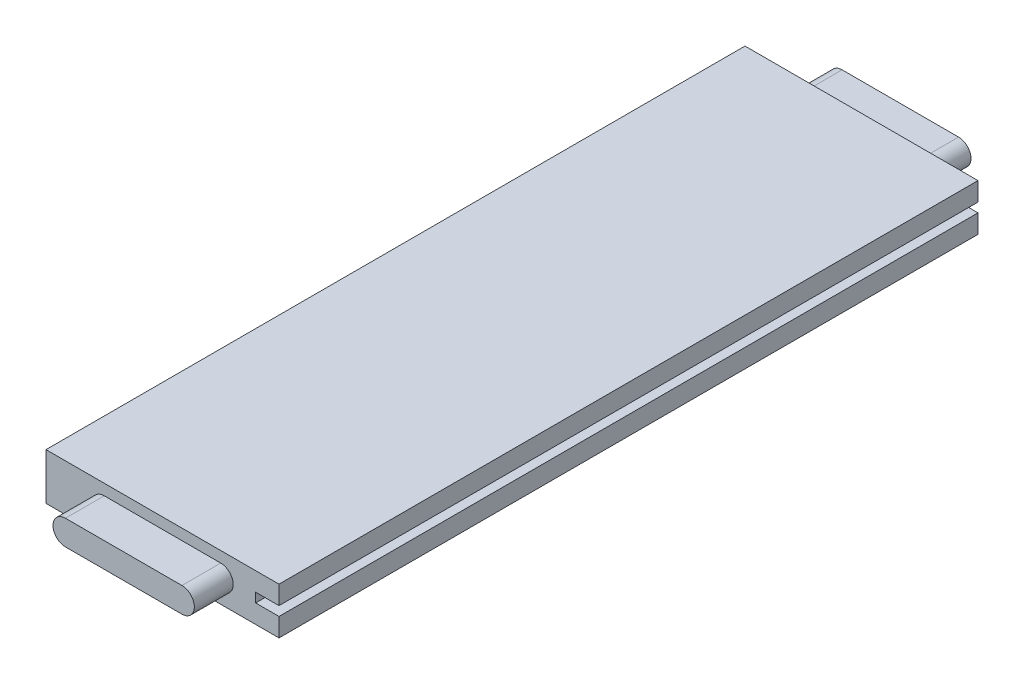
ISO-10303-21;
HEADER;
FILE_DESCRIPTION(('STEP AP214'),'2;1');
FILE_NAME('part.step','',(''),(''),'','','');
FILE_SCHEMA(('AUTOMOTIVE_DESIGN { 1 0 10303 214 1 1 1 1 }'));
ENDSEC;
DATA;
#1=APPLICATION_CONTEXT('core data for automotive mechanical design processes');
#2=APPLICATION_PROTOCOL_DEFINITION('international standard','automotive_design',2000,#1);
#3=PRODUCT_CONTEXT('',#1,'mechanical');
#4=PRODUCT('Part','Part','',(#3));
#5=PRODUCT_RELATED_PRODUCT_CATEGORY('part','',(#4));
#6=PRODUCT_DEFINITION_FORMATION('','',#4);
#7=PRODUCT_DEFINITION_CONTEXT('part definition',#1,'design');
#8=PRODUCT_DEFINITION('design','',#6,#7);
#9=PRODUCT_DEFINITION_SHAPE('','',#8);
#10=(LENGTH_UNIT() NAMED_UNIT(*) SI_UNIT(.MILLI.,.METRE.));
#11=(NAMED_UNIT(*) PLANE_ANGLE_UNIT() SI_UNIT($,.RADIAN.));
#12=(NAMED_UNIT(*) SI_UNIT($,.STERADIAN.) SOLID_ANGLE_UNIT());
#13=UNCERTAINTY_MEASURE_WITH_UNIT(LENGTH_MEASURE(1.E-05),#10,'distance_accuracy_value','');
#14=(GEOMETRIC_REPRESENTATION_CONTEXT(3) GLOBAL_UNCERTAINTY_ASSIGNED_CONTEXT((#13)) GLOBAL_UNIT_ASSIGNED_CONTEXT((#10,
#11,#12)) REPRESENTATION_CONTEXT('',''));
#15=CARTESIAN_POINT('',(0.,0.,0.));
#16=DIRECTION('',(0.,0.,1.));
#17=DIRECTION('',(1.,0.,0.));
#18=AXIS2_PLACEMENT_3D('',#15,#16,#17);
#19=CARTESIAN_POINT('',(75.,15.,-275.));
#20=DIRECTION('',(1.,0.,0.));
#21=DIRECTION('',(0.,0.,-1.));
#22=AXIS2_PLACEMENT_3D('',#19,#20,#21);
#23=PLANE('',#22);
#24=DIRECTION('',(0.,1.,0.));
#25=VECTOR('',#24,1.);
#26=CARTESIAN_POINT('',(75.,-15.,-225.));
#27=LINE('',#26,#25);
#28=CARTESIAN_POINT('',(75.,-15.,-225.));
#29=VERTEX_POINT('',#28);
#30=CARTESIAN_POINT('',(74.9999999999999,-3.00000000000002,-225.));
#31=VERTEX_POINT('',#30);
#32=EDGE_CURVE('E191',#29,#31,#27,.T.);
#33=ORIENTED_EDGE('',*,*,#32,.T.);
#34=DIRECTION('',(0.,0.,-1.));
#35=VECTOR('',#34,1.);
#36=CARTESIAN_POINT('',(74.9999999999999,-3.00000000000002,250.));
#37=LINE('',#36,#35);
#38=CARTESIAN_POINT('',(74.9999999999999,-3.00000000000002,225.));
#39=VERTEX_POINT('',#38);
#40=EDGE_CURVE('E266',#39,#31,#37,.T.);
#41=ORIENTED_EDGE('',*,*,#40,.F.);
#42=DIRECTION('',(0.,1.,0.));
#43=VECTOR('',#42,1.);
#44=CARTESIAN_POINT('',(75.,-15.,225.));
#45=LINE('',#44,#43);
#46=CARTESIAN_POINT('',(75.,-15.,225.));
#47=VERTEX_POINT('',#46);
#48=EDGE_CURVE('E260',#47,#39,#45,.T.);
#49=ORIENTED_EDGE('',*,*,#48,.F.);
#50=DIRECTION('',(0.,0.,1.));
#51=VECTOR('',#50,1.);
#52=CARTESIAN_POINT('',(75.,-15.,-275.));
#53=LINE('',#52,#51);
#54=EDGE_CURVE('E274',#29,#47,#53,.T.);
#55=ORIENTED_EDGE('',*,*,#54,.F.);
#56=EDGE_LOOP('',(#33,#41,#49,#55));
#57=FACE_BOUND('',#56,.T.);
#58=ADVANCED_FACE('F35',(#57),#23,.T.);
#59=CARTESIAN_POINT('',(-75.,15.,-275.));
#60=DIRECTION('',(-1.,0.,0.));
#61=DIRECTION('',(0.,0.,1.));
#62=AXIS2_PLACEMENT_3D('',#59,#60,#61);
#63=PLANE('',#62);
#64=DIRECTION('',(0.,-1.,0.));
#65=VECTOR('',#64,1.);
#66=CARTESIAN_POINT('',(-75.,15.,-225.));
#67=LINE('',#66,#65);
#68=CARTESIAN_POINT('',(-75.,15.,-225.));
#69=VERTEX_POINT('',#68);
#70=CARTESIAN_POINT('',(-75.,-15.,-225.));
#71=VERTEX_POINT('',#70);
#72=EDGE_CURVE('E197',#69,#71,#67,.T.);
#73=ORIENTED_EDGE('',*,*,#72,.T.);
#74=DIRECTION('',(0.,0.,1.));
#75=VECTOR('',#74,1.);
#76=CARTESIAN_POINT('',(-75.,-15.,-275.));
#77=LINE('',#76,#75);
#78=CARTESIAN_POINT('',(-75.,-15.,225.));
#79=VERTEX_POINT('',#78);
#80=EDGE_CURVE('E39',#71,#79,#77,.T.);
#81=ORIENTED_EDGE('',*,*,#80,.T.);
#82=DIRECTION('',(0.,-1.,0.));
#83=VECTOR('',#82,1.);
#84=CARTESIAN_POINT('',(-75.,15.,225.));
#85=LINE('',#84,#83);
#86=CARTESIAN_POINT('',(-75.,15.,225.));
#87=VERTEX_POINT('',#86);
#88=EDGE_CURVE('E254',#87,#79,#85,.T.);
#89=ORIENTED_EDGE('',*,*,#88,.F.);
#90=DIRECTION('',(0.,0.,1.));
#91=VECTOR('',#90,1.);
#92=CARTESIAN_POINT('',(-75.,15.,-275.));
#93=LINE('',#92,#91);
#94=EDGE_CURVE('E11',#69,#87,#93,.T.);
#95=ORIENTED_EDGE('',*,*,#94,.F.);
#96=EDGE_LOOP('',(#73,#81,#89,#95));
#97=FACE_BOUND('',#96,.T.);
#98=ADVANCED_FACE('F37',(#97),#63,.T.);
#99=CARTESIAN_POINT('',(-75.,15.,-275.));
#100=DIRECTION('',(0.,1.,0.));
#101=DIRECTION('',(0.,0.,1.));
#102=AXIS2_PLACEMENT_3D('',#99,#100,#101);
#103=PLANE('',#102);
#104=DIRECTION('',(-1.,0.,0.));
#105=VECTOR('',#104,1.);
#106=CARTESIAN_POINT('',(75.,15.,-225.));
#107=LINE('',#106,#105);
#108=CARTESIAN_POINT('',(75.,15.,-225.));
#109=VERTEX_POINT('',#108);
#110=EDGE_CURVE('E200',#109,#69,#107,.T.);
#111=ORIENTED_EDGE('',*,*,#110,.T.);
#112=ORIENTED_EDGE('',*,*,#94,.T.);
#113=DIRECTION('',(-1.,0.,0.));
#114=VECTOR('',#113,1.);
#115=CARTESIAN_POINT('',(75.,15.,225.));
#116=LINE('',#115,#114);
#117=CARTESIAN_POINT('',(75.,15.,225.));
#118=VERTEX_POINT('',#117);
#119=EDGE_CURVE('E251',#118,#87,#116,.T.);
#120=ORIENTED_EDGE('',*,*,#119,.F.);
#121=DIRECTION('',(0.,0.,1.));
#122=VECTOR('',#121,1.);
#123=CARTESIAN_POINT('',(75.,15.,-275.));
#124=LINE('',#123,#122);
#125=EDGE_CURVE('E44',#109,#118,#124,.T.);
#126=ORIENTED_EDGE('',*,*,#125,.F.);
#127=EDGE_LOOP('',(#111,#112,#120,#126));
#128=FACE_BOUND('',#127,.T.);
#129=ADVANCED_FACE('F297',(#128),#103,.T.);
#130=DIRECTION('',(0.,1.,0.));
#131=VECTOR('',#130,1.);
#132=CARTESIAN_POINT('',(75.,2.99999999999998,-225.));
#133=LINE('',#132,#131);
#134=CARTESIAN_POINT('',(75.,2.99999999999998,-225.));
#135=VERTEX_POINT('',#134);
#136=EDGE_CURVE('E60',#135,#109,#133,.T.);
#137=ORIENTED_EDGE('',*,*,#136,.T.);
#138=ORIENTED_EDGE('',*,*,#125,.T.);
#139=DIRECTION('',(0.,1.,0.));
#140=VECTOR('',#139,1.);
#141=CARTESIAN_POINT('',(75.,2.99999999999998,225.));
#142=LINE('',#141,#140);
#143=CARTESIAN_POINT('',(75.,2.99999999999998,225.));
#144=VERTEX_POINT('',#143);
#145=EDGE_CURVE('E248',#144,#118,#142,.T.);
#146=ORIENTED_EDGE('',*,*,#145,.F.);
#147=DIRECTION('',(0.,0.,-1.));
#148=VECTOR('',#147,1.);
#149=CARTESIAN_POINT('',(74.9999999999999,2.99999999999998,250.));
#150=LINE('',#149,#148);
#151=EDGE_CURVE('E269',#144,#135,#150,.T.);
#152=ORIENTED_EDGE('',*,*,#151,.T.);
#153=EDGE_LOOP('',(#137,#138,#146,#152));
#154=FACE_BOUND('',#153,.T.);
#155=ADVANCED_FACE('F289',(#154),#23,.T.);
#156=CARTESIAN_POINT('',(75.,-15.,-275.));
#157=DIRECTION('',(0.,-1.,0.));
#158=DIRECTION('',(1.,0.,0.));
#159=AXIS2_PLACEMENT_3D('',#156,#157,#158);
#160=PLANE('',#159);
#161=DIRECTION('',(1.,0.,0.));
#162=VECTOR('',#161,1.);
#163=CARTESIAN_POINT('',(-75.,-15.,-225.));
#164=LINE('',#163,#162);
#165=EDGE_CURVE('E194',#71,#29,#164,.T.);
#166=ORIENTED_EDGE('',*,*,#165,.T.);
#167=ORIENTED_EDGE('',*,*,#54,.T.);
#168=DIRECTION('',(1.,0.,0.));
#169=VECTOR('',#168,1.);
#170=CARTESIAN_POINT('',(-75.,-15.,225.));
#171=LINE('',#170,#169);
#172=EDGE_CURVE('E257',#79,#47,#171,.T.);
#173=ORIENTED_EDGE('',*,*,#172,.F.);
#174=ORIENTED_EDGE('',*,*,#80,.F.);
#175=EDGE_LOOP('',(#166,#167,#173,#174));
#176=FACE_BOUND('',#175,.T.);
#177=ADVANCED_FACE('F286',(#176),#160,.T.);
#178=CARTESIAN_POINT('',(59.9999999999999,-3.00000000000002,250.));
#179=DIRECTION('',(-1.,0.,0.));
#180=DIRECTION('',(0.,0.,1.));
#181=AXIS2_PLACEMENT_3D('',#178,#179,#180);
#182=PLANE('',#181);
#183=DIRECTION('',(0.,0.,-1.));
#184=VECTOR('',#183,1.);
#185=CARTESIAN_POINT('',(59.9999999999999,-3.00000000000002,250.));
#186=LINE('',#185,#184);
#187=CARTESIAN_POINT('',(59.9999999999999,-3.00000000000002,225.));
#188=VERTEX_POINT('',#187);
#189=CARTESIAN_POINT('',(59.9999999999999,-3.00000000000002,-225.));
#190=VERTEX_POINT('',#189);
#191=EDGE_CURVE('E263',#188,#190,#186,.T.);
#192=ORIENTED_EDGE('',*,*,#191,.T.);
#193=DIRECTION('',(0.,1.,0.));
#194=VECTOR('',#193,1.);
#195=CARTESIAN_POINT('',(59.9999999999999,-3.00000000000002,-225.));
#196=LINE('',#195,#194);
#197=CARTESIAN_POINT('',(59.9999999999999,2.99999999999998,-225.));
#198=VERTEX_POINT('',#197);
#199=EDGE_CURVE('E206',#190,#198,#196,.T.);
#200=ORIENTED_EDGE('',*,*,#199,.T.);
#201=DIRECTION('',(0.,0.,-1.));
#202=VECTOR('',#201,1.);
#203=CARTESIAN_POINT('',(59.9999999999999,2.99999999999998,250.));
#204=LINE('',#203,#202);
#205=CARTESIAN_POINT('',(59.9999999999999,2.99999999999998,225.));
#206=VERTEX_POINT('',#205);
#207=EDGE_CURVE('E262',#206,#198,#204,.T.);
#208=ORIENTED_EDGE('',*,*,#207,.F.);
#209=DIRECTION('',(0.,1.,0.));
#210=VECTOR('',#209,1.);
#211=CARTESIAN_POINT('',(59.9999999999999,-3.00000000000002,225.));
#212=LINE('',#211,#210);
#213=EDGE_CURVE('E244',#188,#206,#212,.T.);
#214=ORIENTED_EDGE('',*,*,#213,.F.);
#215=EDGE_LOOP('',(#192,#200,#208,#214));
#216=FACE_BOUND('',#215,.T.);
#217=ADVANCED_FACE('F288',(#216),#182,.F.);
#218=CARTESIAN_POINT('',(59.9999999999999,-3.00000000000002,250.));
#219=DIRECTION('',(0.,-1.,0.));
#220=DIRECTION('',(1.,0.,0.));
#221=AXIS2_PLACEMENT_3D('',#218,#219,#220);
#222=PLANE('',#221);
#223=ORIENTED_EDGE('',*,*,#40,.T.);
#224=DIRECTION('',(-1.,0.,0.));
#225=VECTOR('',#224,1.);
#226=CARTESIAN_POINT('',(74.9999999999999,-3.00000000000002,-225.));
#227=LINE('',#226,#225);
#228=EDGE_CURVE('E185',#31,#190,#227,.T.);
#229=ORIENTED_EDGE('',*,*,#228,.T.);
#230=ORIENTED_EDGE('',*,*,#191,.F.);
#231=DIRECTION('',(-1.,0.,0.));
#232=VECTOR('',#231,1.);
#233=CARTESIAN_POINT('',(74.9999999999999,-3.00000000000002,225.));
#234=LINE('',#233,#232);
#235=EDGE_CURVE('E236',#39,#188,#234,.T.);
#236=ORIENTED_EDGE('',*,*,#235,.F.);
#237=EDGE_LOOP('',(#223,#229,#230,#236));
#238=FACE_BOUND('',#237,.T.);
#239=ADVANCED_FACE('F294',(#238),#222,.F.);
#240=CARTESIAN_POINT('',(59.9999999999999,2.99999999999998,250.));
#241=DIRECTION('',(0.,1.,0.));
#242=DIRECTION('',(-1.,0.,0.));
#243=AXIS2_PLACEMENT_3D('',#240,#241,#242);
#244=PLANE('',#243);
#245=ORIENTED_EDGE('',*,*,#207,.T.);
#246=DIRECTION('',(1.,0.,0.));
#247=VECTOR('',#246,1.);
#248=CARTESIAN_POINT('',(59.9999999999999,2.99999999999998,-225.));
#249=LINE('',#248,#247);
#250=EDGE_CURVE('E204',#198,#135,#249,.T.);
#251=ORIENTED_EDGE('',*,*,#250,.T.);
#252=ORIENTED_EDGE('',*,*,#151,.F.);
#253=DIRECTION('',(1.,0.,0.));
#254=VECTOR('',#253,1.);
#255=CARTESIAN_POINT('',(59.9999999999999,2.99999999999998,225.));
#256=LINE('',#255,#254);
#257=EDGE_CURVE('E246',#206,#144,#256,.T.);
#258=ORIENTED_EDGE('',*,*,#257,.F.);
#259=EDGE_LOOP('',(#245,#251,#252,#258));
#260=FACE_BOUND('',#259,.T.);
#261=ADVANCED_FACE('F318',(#260),#244,.F.);
#262=CARTESIAN_POINT('',(0.,0.,225.));
#263=DIRECTION('',(0.,0.,-1.));
#264=DIRECTION('',(-1.,0.,0.));
#265=AXIS2_PLACEMENT_3D('',#262,#263,#264);
#266=PLANE('',#265);
#267=CARTESIAN_POINT('',(-37.5,0.,225.));
#268=DIRECTION('',(0.,0.,1.));
#269=DIRECTION('',(1.,0.,0.));
#270=AXIS2_PLACEMENT_3D('',#267,#268,#269);
#271=CIRCLE('',#270,8.);
#272=CARTESIAN_POINT('',(-37.5,8.,225.));
#273=VERTEX_POINT('',#272);
#274=CARTESIAN_POINT('',(-37.5,-8.,225.));
#275=VERTEX_POINT('',#274);
#276=EDGE_CURVE('E210',#273,#275,#271,.T.);
#277=ORIENTED_EDGE('',*,*,#276,.F.);
#278=DIRECTION('',(-1.,0.,0.));
#279=VECTOR('',#278,1.);
#280=CARTESIAN_POINT('',(-37.5,8.,225.));
#281=LINE('',#280,#279);
#282=CARTESIAN_POINT('',(37.5,8.,225.));
#283=VERTEX_POINT('',#282);
#284=EDGE_CURVE('E220',#283,#273,#281,.T.);
#285=ORIENTED_EDGE('',*,*,#284,.F.);
#286=CARTESIAN_POINT('',(37.5,0.,225.));
#287=DIRECTION('',(0.,0.,1.));
#288=DIRECTION('',(1.,0.,0.));
#289=AXIS2_PLACEMENT_3D('',#286,#287,#288);
#290=CIRCLE('',#289,8.);
#291=CARTESIAN_POINT('',(37.5,-8.,225.));
#292=VERTEX_POINT('',#291);
#293=EDGE_CURVE('E217',#292,#283,#290,.T.);
#294=ORIENTED_EDGE('',*,*,#293,.F.);
#295=DIRECTION('',(1.,0.,0.));
#296=VECTOR('',#295,1.);
#297=CARTESIAN_POINT('',(-37.5,-8.,225.));
#298=LINE('',#297,#296);
#299=EDGE_CURVE('E213',#275,#292,#298,.T.);
#300=ORIENTED_EDGE('',*,*,#299,.F.);
#301=EDGE_LOOP('',(#277,#285,#294,#300));
#302=FACE_BOUND('',#301,.T.);
#303=ORIENTED_EDGE('',*,*,#235,.T.);
#304=ORIENTED_EDGE('',*,*,#213,.T.);
#305=ORIENTED_EDGE('',*,*,#257,.T.);
#306=ORIENTED_EDGE('',*,*,#145,.T.);
#307=ORIENTED_EDGE('',*,*,#119,.T.);
#308=ORIENTED_EDGE('',*,*,#88,.T.);
#309=ORIENTED_EDGE('',*,*,#172,.T.);
#310=ORIENTED_EDGE('',*,*,#48,.T.);
#311=EDGE_LOOP('',(#303,#304,#305,#306,#307,#308,#309,#310));
#312=FACE_BOUND('',#311,.T.);
#313=ADVANCED_FACE('F283',(#302,#312),#266,.F.);
#314=CARTESIAN_POINT('',(-37.5,0.,225.));
#315=DIRECTION('',(0.,0.,1.));
#316=DIRECTION('',(1.,0.,0.));
#317=AXIS2_PLACEMENT_3D('',#314,#315,#316);
#318=CYLINDRICAL_SURFACE('',#317,8.);
#319=CARTESIAN_POINT('',(-37.5,0.,250.));
#320=DIRECTION('',(0.,0.,1.));
#321=DIRECTION('',(1.,0.,0.));
#322=AXIS2_PLACEMENT_3D('',#319,#320,#321);
#323=CIRCLE('',#322,8.);
#324=CARTESIAN_POINT('',(-37.5,8.,250.));
#325=VERTEX_POINT('',#324);
#326=CARTESIAN_POINT('',(-37.5,-8.,250.));
#327=VERTEX_POINT('',#326);
#328=EDGE_CURVE('E209',#325,#327,#323,.T.);
#329=ORIENTED_EDGE('',*,*,#328,.F.);
#330=DIRECTION('',(0.,0.,1.));
#331=VECTOR('',#330,1.);
#332=CARTESIAN_POINT('',(-37.5,8.,225.));
#333=LINE('',#332,#331);
#334=EDGE_CURVE('E234',#273,#325,#333,.T.);
#335=ORIENTED_EDGE('',*,*,#334,.F.);
#336=ORIENTED_EDGE('',*,*,#276,.T.);
#337=DIRECTION('',(0.,0.,1.));
#338=VECTOR('',#337,1.);
#339=CARTESIAN_POINT('',(-37.5,-8.,225.));
#340=LINE('',#339,#338);
#341=EDGE_CURVE('E223',#275,#327,#340,.T.);
#342=ORIENTED_EDGE('',*,*,#341,.T.);
#343=EDGE_LOOP('',(#329,#335,#336,#342));
#344=FACE_BOUND('',#343,.T.);
#345=ADVANCED_FACE('F327',(#344),#318,.T.);
#346=CARTESIAN_POINT('',(-37.5,8.,225.));
#347=DIRECTION('',(0.,1.,0.));
#348=DIRECTION('',(0.,0.,1.));
#349=AXIS2_PLACEMENT_3D('',#346,#347,#348);
#350=PLANE('',#349);
#351=DIRECTION('',(-1.,0.,0.));
#352=VECTOR('',#351,1.);
#353=CARTESIAN_POINT('',(-37.5,8.,250.));
#354=LINE('',#353,#352);
#355=CARTESIAN_POINT('',(37.5,8.,250.));
#356=VERTEX_POINT('',#355);
#357=EDGE_CURVE('E214',#356,#325,#354,.T.);
#358=ORIENTED_EDGE('',*,*,#357,.F.);
#359=DIRECTION('',(0.,0.,1.));
#360=VECTOR('',#359,1.);
#361=CARTESIAN_POINT('',(37.5,8.,225.));
#362=LINE('',#361,#360);
#363=EDGE_CURVE('E237',#283,#356,#362,.T.);
#364=ORIENTED_EDGE('',*,*,#363,.F.);
#365=ORIENTED_EDGE('',*,*,#284,.T.);
#366=ORIENTED_EDGE('',*,*,#334,.T.);
#367=EDGE_LOOP('',(#358,#364,#365,#366));
#368=FACE_BOUND('',#367,.T.);
#369=ADVANCED_FACE('F331',(#368),#350,.T.);
#370=CARTESIAN_POINT('',(37.5,0.,225.));
#371=DIRECTION('',(0.,0.,1.));
#372=DIRECTION('',(1.,0.,0.));
#373=AXIS2_PLACEMENT_3D('',#370,#371,#372);
#374=CYLINDRICAL_SURFACE('',#373,8.);
#375=CARTESIAN_POINT('',(37.5,0.,250.));
#376=DIRECTION('',(0.,0.,1.));
#377=DIRECTION('',(1.,0.,0.));
#378=AXIS2_PLACEMENT_3D('',#375,#376,#377);
#379=CIRCLE('',#378,8.);
#380=CARTESIAN_POINT('',(37.5,-8.,250.));
#381=VERTEX_POINT('',#380);
#382=EDGE_CURVE('E229',#381,#356,#379,.T.);
#383=ORIENTED_EDGE('',*,*,#382,.F.);
#384=DIRECTION('',(0.,0.,1.));
#385=VECTOR('',#384,1.);
#386=CARTESIAN_POINT('',(37.5,-8.,225.));
#387=LINE('',#386,#385);
#388=EDGE_CURVE('E239',#292,#381,#387,.T.);
#389=ORIENTED_EDGE('',*,*,#388,.F.);
#390=ORIENTED_EDGE('',*,*,#293,.T.);
#391=ORIENTED_EDGE('',*,*,#363,.T.);
#392=EDGE_LOOP('',(#383,#389,#390,#391));
#393=FACE_BOUND('',#392,.T.);
#394=ADVANCED_FACE('F335',(#393),#374,.T.);
#395=CARTESIAN_POINT('',(-37.5,-8.,225.));
#396=DIRECTION('',(0.,-1.,0.));
#397=DIRECTION('',(0.,0.,-1.));
#398=AXIS2_PLACEMENT_3D('',#395,#396,#397);
#399=PLANE('',#398);
#400=DIRECTION('',(1.,0.,0.));
#401=VECTOR('',#400,1.);
#402=CARTESIAN_POINT('',(-37.5,-8.,250.));
#403=LINE('',#402,#401);
#404=EDGE_CURVE('E226',#327,#381,#403,.T.);
#405=ORIENTED_EDGE('',*,*,#404,.F.);
#406=ORIENTED_EDGE('',*,*,#341,.F.);
#407=ORIENTED_EDGE('',*,*,#299,.T.);
#408=ORIENTED_EDGE('',*,*,#388,.T.);
#409=EDGE_LOOP('',(#405,#406,#407,#408));
#410=FACE_BOUND('',#409,.T.);
#411=ADVANCED_FACE('F315',(#410),#399,.T.);
#412=CARTESIAN_POINT('',(75.,-15.,250.));
#413=DIRECTION('',(0.,0.,-1.));
#414=DIRECTION('',(-1.,0.,0.));
#415=AXIS2_PLACEMENT_3D('',#412,#413,#414);
#416=PLANE('',#415);
#417=ORIENTED_EDGE('',*,*,#328,.T.);
#418=ORIENTED_EDGE('',*,*,#404,.T.);
#419=ORIENTED_EDGE('',*,*,#382,.T.);
#420=ORIENTED_EDGE('',*,*,#357,.T.);
#421=EDGE_LOOP('',(#417,#418,#419,#420));
#422=FACE_BOUND('',#421,.T.);
#423=ADVANCED_FACE('F313',(#422),#416,.F.);
#424=CARTESIAN_POINT('',(0.,0.,-225.));
#425=DIRECTION('',(0.,0.,1.));
#426=DIRECTION('',(-1.,0.,0.));
#427=AXIS2_PLACEMENT_3D('',#424,#425,#426);
#428=PLANE('',#427);
#429=ORIENTED_EDGE('',*,*,#228,.F.);
#430=ORIENTED_EDGE('',*,*,#32,.F.);
#431=ORIENTED_EDGE('',*,*,#165,.F.);
#432=ORIENTED_EDGE('',*,*,#72,.F.);
#433=ORIENTED_EDGE('',*,*,#110,.F.);
#434=ORIENTED_EDGE('',*,*,#136,.F.);
#435=ORIENTED_EDGE('',*,*,#250,.F.);
#436=ORIENTED_EDGE('',*,*,#199,.F.);
#437=EDGE_LOOP('',(#429,#430,#431,#432,#433,#434,#435,#436));
#438=FACE_BOUND('',#437,.T.);
#439=DIRECTION('',(1.,0.,0.));
#440=VECTOR('',#439,1.);
#441=CARTESIAN_POINT('',(-37.5,-8.,-225.));
#442=LINE('',#441,#440);
#443=CARTESIAN_POINT('',(-37.5,-8.,-225.));
#444=VERTEX_POINT('',#443);
#445=CARTESIAN_POINT('',(37.5,-8.,-225.));
#446=VERTEX_POINT('',#445);
#447=EDGE_CURVE('E168',#444,#446,#442,.T.);
#448=ORIENTED_EDGE('',*,*,#447,.T.);
#449=CARTESIAN_POINT('',(37.5,0.,-225.));
#450=DIRECTION('',(0.,0.,1.));
#451=DIRECTION('',(1.,0.,0.));
#452=AXIS2_PLACEMENT_3D('',#449,#450,#451);
#453=CIRCLE('',#452,8.);
#454=CARTESIAN_POINT('',(37.5,8.,-225.));
#455=VERTEX_POINT('',#454);
#456=EDGE_CURVE('E156',#446,#455,#453,.T.);
#457=ORIENTED_EDGE('',*,*,#456,.T.);
#458=DIRECTION('',(-1.,0.,0.));
#459=VECTOR('',#458,1.);
#460=CARTESIAN_POINT('',(-37.5,8.,-225.));
#461=LINE('',#460,#459);
#462=CARTESIAN_POINT('',(-37.5,8.,-225.));
#463=VERTEX_POINT('',#462);
#464=EDGE_CURVE('E149',#455,#463,#461,.T.);
#465=ORIENTED_EDGE('',*,*,#464,.T.);
#466=CARTESIAN_POINT('',(-37.5,0.,-225.));
#467=DIRECTION('',(0.,0.,1.));
#468=DIRECTION('',(1.,0.,0.));
#469=AXIS2_PLACEMENT_3D('',#466,#467,#468);
#470=CIRCLE('',#469,8.);
#471=EDGE_CURVE('E153',#463,#444,#470,.T.);
#472=ORIENTED_EDGE('',*,*,#471,.T.);
#473=EDGE_LOOP('',(#448,#457,#465,#472));
#474=FACE_BOUND('',#473,.T.);
#475=ADVANCED_FACE('F151',(#438,#474),#428,.F.);
#476=CARTESIAN_POINT('',(-37.5,0.,-225.));
#477=DIRECTION('',(0.,0.,-1.));
#478=DIRECTION('',(-1.,0.,0.));
#479=AXIS2_PLACEMENT_3D('',#476,#477,#478);
#480=CYLINDRICAL_SURFACE('',#479,8.);
#481=CARTESIAN_POINT('',(-37.5,0.,-250.));
#482=DIRECTION('',(0.,0.,1.));
#483=DIRECTION('',(1.,0.,0.));
#484=AXIS2_PLACEMENT_3D('',#481,#482,#483);
#485=CIRCLE('',#484,8.);
#486=CARTESIAN_POINT('',(-37.5,8.,-250.));
#487=VERTEX_POINT('',#486);
#488=CARTESIAN_POINT('',(-37.5,-8.,-250.));
#489=VERTEX_POINT('',#488);
#490=EDGE_CURVE('E180',#487,#489,#485,.T.);
#491=ORIENTED_EDGE('',*,*,#490,.T.);
#492=DIRECTION('',(0.,0.,-1.));
#493=VECTOR('',#492,1.);
#494=CARTESIAN_POINT('',(-37.5,-8.,-225.));
#495=LINE('',#494,#493);
#496=EDGE_CURVE('E171',#444,#489,#495,.T.);
#497=ORIENTED_EDGE('',*,*,#496,.F.);
#498=ORIENTED_EDGE('',*,*,#471,.F.);
#499=DIRECTION('',(0.,0.,-1.));
#500=VECTOR('',#499,1.);
#501=CARTESIAN_POINT('',(-37.5,8.,-225.));
#502=LINE('',#501,#500);
#503=EDGE_CURVE('E160',#463,#487,#502,.T.);
#504=ORIENTED_EDGE('',*,*,#503,.T.);
#505=EDGE_LOOP('',(#491,#497,#498,#504));
#506=FACE_BOUND('',#505,.T.);
#507=ADVANCED_FACE('F170',(#506),#480,.T.);
#508=CARTESIAN_POINT('',(-37.5,-8.,-225.));
#509=DIRECTION('',(0.,1.,0.));
#510=DIRECTION('',(0.,0.,1.));
#511=AXIS2_PLACEMENT_3D('',#508,#509,#510);
#512=PLANE('',#511);
#513=DIRECTION('',(1.,0.,0.));
#514=VECTOR('',#513,1.);
#515=CARTESIAN_POINT('',(-37.5,-8.,-250.));
#516=LINE('',#515,#514);
#517=CARTESIAN_POINT('',(37.5,-8.,-250.));
#518=VERTEX_POINT('',#517);
#519=EDGE_CURVE('E173',#489,#518,#516,.T.);
#520=ORIENTED_EDGE('',*,*,#519,.T.);
#521=DIRECTION('',(0.,0.,-1.));
#522=VECTOR('',#521,1.);
#523=CARTESIAN_POINT('',(37.5,-8.,-225.));
#524=LINE('',#523,#522);
#525=EDGE_CURVE('E186',#446,#518,#524,.T.);
#526=ORIENTED_EDGE('',*,*,#525,.F.);
#527=ORIENTED_EDGE('',*,*,#447,.F.);
#528=ORIENTED_EDGE('',*,*,#496,.T.);
#529=EDGE_LOOP('',(#520,#526,#527,#528));
#530=FACE_BOUND('',#529,.T.);
#531=ADVANCED_FACE('F347',(#530),#512,.F.);
#532=CARTESIAN_POINT('',(37.5,0.,-225.));
#533=DIRECTION('',(0.,0.,-1.));
#534=DIRECTION('',(-1.,0.,0.));
#535=AXIS2_PLACEMENT_3D('',#532,#533,#534);
#536=CYLINDRICAL_SURFACE('',#535,8.);
#537=CARTESIAN_POINT('',(37.5,0.,-250.));
#538=DIRECTION('',(0.,0.,1.));
#539=DIRECTION('',(1.,0.,0.));
#540=AXIS2_PLACEMENT_3D('',#537,#538,#539);
#541=CIRCLE('',#540,8.);
#542=CARTESIAN_POINT('',(37.5,8.,-250.));
#543=VERTEX_POINT('',#542);
#544=EDGE_CURVE('E52',#518,#543,#541,.T.);
#545=ORIENTED_EDGE('',*,*,#544,.T.);
#546=DIRECTION('',(0.,0.,-1.));
#547=VECTOR('',#546,1.);
#548=CARTESIAN_POINT('',(37.5,8.,-225.));
#549=LINE('',#548,#547);
#550=EDGE_CURVE('E167',#455,#543,#549,.T.);
#551=ORIENTED_EDGE('',*,*,#550,.F.);
#552=ORIENTED_EDGE('',*,*,#456,.F.);
#553=ORIENTED_EDGE('',*,*,#525,.T.);
#554=EDGE_LOOP('',(#545,#551,#552,#553));
#555=FACE_BOUND('',#554,.T.);
#556=ADVANCED_FACE('F350',(#555),#536,.T.);
#557=CARTESIAN_POINT('',(-37.5,8.,-225.));
#558=DIRECTION('',(0.,-1.,0.));
#559=DIRECTION('',(0.,0.,-1.));
#560=AXIS2_PLACEMENT_3D('',#557,#558,#559);
#561=PLANE('',#560);
#562=DIRECTION('',(-1.,0.,0.));
#563=VECTOR('',#562,1.);
#564=CARTESIAN_POINT('',(-37.5,8.,-250.));
#565=LINE('',#564,#563);
#566=EDGE_CURVE('E163',#543,#487,#565,.T.);
#567=ORIENTED_EDGE('',*,*,#566,.T.);
#568=ORIENTED_EDGE('',*,*,#503,.F.);
#569=ORIENTED_EDGE('',*,*,#464,.F.);
#570=ORIENTED_EDGE('',*,*,#550,.T.);
#571=EDGE_LOOP('',(#567,#568,#569,#570));
#572=FACE_BOUND('',#571,.T.);
#573=ADVANCED_FACE('F161',(#572),#561,.F.);
#574=CARTESIAN_POINT('',(-75.,-15.,-250.));
#575=DIRECTION('',(0.,0.,1.));
#576=DIRECTION('',(1.,0.,0.));
#577=AXIS2_PLACEMENT_3D('',#574,#575,#576);
#578=PLANE('',#577);
#579=ORIENTED_EDGE('',*,*,#519,.F.);
#580=ORIENTED_EDGE('',*,*,#490,.F.);
#581=ORIENTED_EDGE('',*,*,#566,.F.);
#582=ORIENTED_EDGE('',*,*,#544,.F.);
#583=EDGE_LOOP('',(#579,#580,#581,#582));
#584=FACE_BOUND('',#583,.T.);
#585=ADVANCED_FACE('F309',(#584),#578,.F.);
#586=CLOSED_SHELL('',(#58,#98,#129,#155,#177,#217,#239,#261,#313,#345,#369,#394,#411,#423,#475,
#507,#531,#556,#573,#585));
#587=MANIFOLD_SOLID_BREP('B2',#586);
#588=ADVANCED_BREP_SHAPE_REPRESENTATION('',(#18,#587),#14);
#589=SHAPE_DEFINITION_REPRESENTATION(#9,#588);
ENDSEC;
END-ISO-10303-21;
